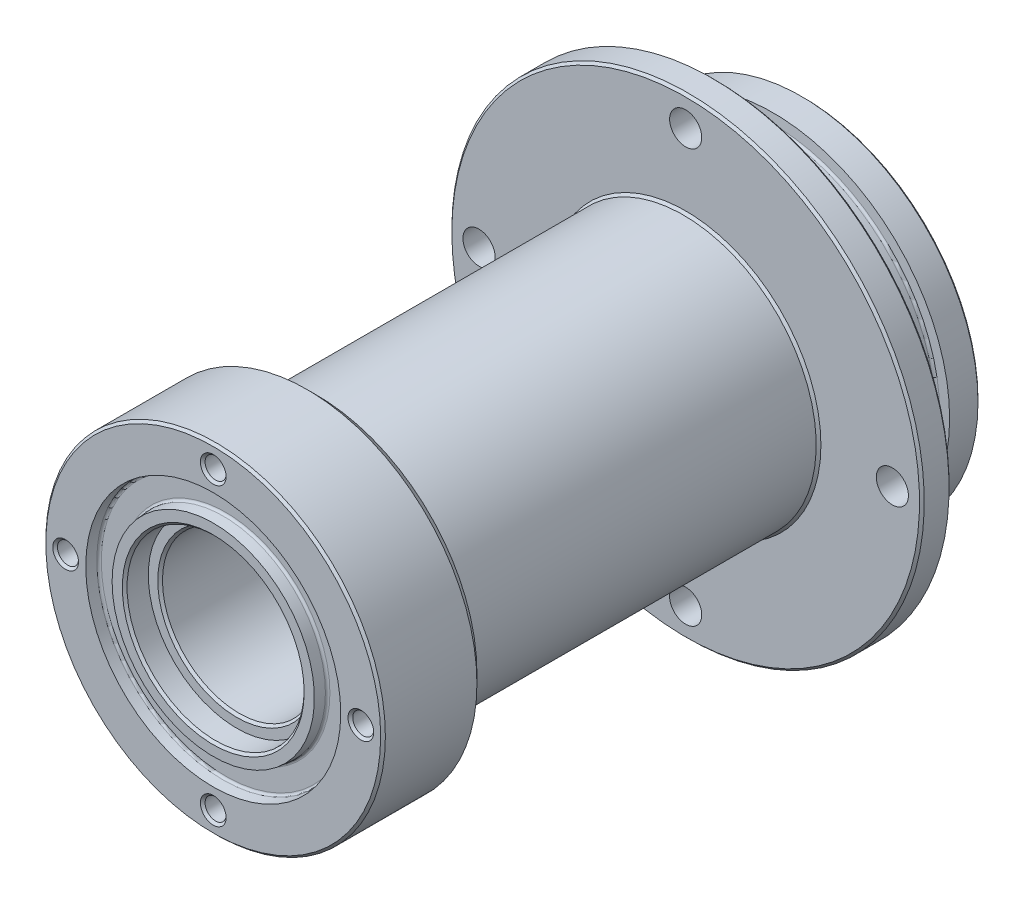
from build123d import *

# Parameters (mm, degrees)
SKETCH1_R           = 18.25625
SKETCH1_R_2         = 7.9883
BODY_DEPTH          = 63.5
SKETCH2_R           = 1.1303
F_4_40_HOLES_DEPTH  = 12.7
SKETCH6_R           = 9.525
CUT_EXTRUDE2_DEPTH  = 2.54
CONNECTOR_SIDE_SIZE = 0.254
SKETCH8_W           = 39.6875
SKETCH8_H           = 6.962926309
CENTER_SIZE         = 1.016
CHAMFER5_SIZE       = 0.254
SKETCH14_R          = 1.7272
MOUNT_HOLES_DEPTH   = 65.835334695
INTRENAL_BORE_SIZE  = 0.254


with BuildPart() as part:
    # Sketch1 → body (new body)
    with BuildSketch(Plane.XY):
        Circle(SKETCH1_R)
        Circle(SKETCH1_R_2, mode=Mode.SUBTRACT)
    extrude(amount=BODY_DEPTH)

    # Sketch2 → 4-40 holes (cut)
    with BuildSketch(Plane.XY.offset(63.5)):
        with Locations((0, 15.875)):
            Circle(SKETCH2_R)
        with Locations((15.875, 0)):
            Circle(SKETCH2_R)
        with Locations((0, -15.875)):
            Circle(SKETCH2_R)
        with Locations((-15.875, 0)):
            Circle(SKETCH2_R)
    extrude(amount=-F_4_40_HOLES_DEPTH, mode=Mode.SUBTRACT)

    # Sketch5 → Groove for AS 568-020_ O-Ring1 (revolve, cut)
    with BuildSketch(Plane(origin=(0, 0, 63.5), x_dir=(0, -1, 0), z_dir=(-1, 0, 0)), mode=Mode.PRIVATE) as groove_for_as_568_020_o_ring1_sk:
        with BuildLine():
            Line((10.9728, -1.088937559), (10.877530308, 0))
            Line((10.877530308, 0), (13.709669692, 0))
            Line((13.709669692, 0), (13.6144, -1.088937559))
            ThreePointArc((13.6144, -1.088937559), (13.532966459, -1.254068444), (13.361366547, -1.3208))
            Line((13.361366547, -1.3208), (11.225833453, -1.3208))
            ThreePointArc((11.225833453, -1.3208), (11.054233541, -1.254068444), (10.9728, -1.088937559))
        make_face()
    revolve(groove_for_as_568_020_o_ring1_sk.sketch.rotate(Axis((0, 0, 113.5), (0, 0, -1)), 90), axis=Axis((0, 0, 113.5), (0, 0, -1)), mode=Mode.SUBTRACT)

    # Sketch6 → Cut-Extrude2 (cut)
    with BuildSketch(Plane.XY.offset(63.5)):
        Circle(SKETCH6_R)
    extrude(amount=-CUT_EXTRUDE2_DEPTH, mode=Mode.SUBTRACT)

    # connector side
    connector_side_edges = [part.edges().sort_by_distance(p)[0] for p in [
        (-1.1303, 15.875, 63.5),
        (14.7447, 0, 63.5),
        (-1.1303, -15.875, 63.5),
        (-17.0053, 0, 63.5),
        (-9.525, 0, 63.5),
        (-18.25625, 0, 63.5),
    ]]
    chamfer(connector_side_edges, length=CONNECTOR_SIDE_SIZE)

    # Sketch8 → center cut (revolve, cut)
    with BuildSketch(Plane(origin=(0, 0, 0), x_dir=(0, 0, -1), z_dir=(1, 0, 0)), mode=Mode.PRIVATE) as center_cut_sk:
        with Locations((-32.54375, 17.768963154)):
            Rectangle(SKETCH8_W, SKETCH8_H)
    revolve(center_cut_sk.sketch.rotate(Axis((0, 0, -3.306435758), (0, 0, 1)), 90), axis=Axis((0, 0, -3.306435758), (0, 0, 1)), mode=Mode.SUBTRACT)

    # center
    center_edges = [part.edges().sort_by_distance(p)[0] for p in [
        (-18.25625, 0, 12.7),
        (-18.25625, 0, 52.3875),
    ]]
    chamfer(center_edges, length=CENTER_SIZE)

    # Sketch11 → flange (revolve)
    with BuildSketch(Plane(origin=(0, 0, 0), x_dir=(0, 0, -1), z_dir=(1, 0, 0)), mode=Mode.PRIVATE) as flange_sk:
        Polygon((-12.7, 16.396142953), (0, 16.396142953), (0, 18.9865), (-9.525, 18.9865), (-9.525, 25.4), (-12.7, 25.4), align=None)
    revolve(flange_sk.sketch.rotate(Axis((0, 0, -3.577141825), (0, 0, 1)), 90), axis=Axis((0, 0, -3.577141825), (0, 0, 1)))

    # Sketch13 → Groove for AS 568-028_ O-Ring1 (revolve, cut)
    with BuildSketch(Plane(origin=(0, 0, -3.577141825), x_dir=(0, 1, 0), z_dir=(-1, 0, 0)), mode=Mode.PRIVATE) as groove_for_as_568_028_o_ring1_sk:
        with BuildLine():
            Line((18.011862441, -6.967620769), (19.1389, -6.869017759))
            Line((19.1389, -6.869017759), (19.1389, -9.428423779))
            Line((19.1389, -9.428423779), (18.011862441, -9.329820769))
            ThreePointArc((18.011862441, -9.329820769), (17.846731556, -9.248387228), (17.78, -9.076787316))
            Line((17.78, -9.076787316), (17.78, -7.220654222))
            ThreePointArc((17.78, -7.220654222), (17.846731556, -7.04905431), (18.011862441, -6.967620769))
        make_face()
    revolve(groove_for_as_568_028_o_ring1_sk.sketch.rotate(Axis((0, 0, -53.577141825), (0, 0, 1)), 270), axis=Axis((0, 0, -53.577141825), (0, 0, 1)), mode=Mode.SUBTRACT)

    # Chamfer5
    chamfer5_edges = [part.edges().sort_by_distance(p)[0] for p in [
        (-7.9883, 0, 0),
        (14.2875, 0, 52.3875),
        (14.2875, 0, 12.7),
        (18.9865, 0, 0),
        (25.4, 0, 9.525),
        (25.4, 0, 12.7),
    ]]
    chamfer(chamfer5_edges, length=CHAMFER5_SIZE)

    # Sketch14 → mount holes (cut, through all)
    with BuildSketch(Plane(origin=(0, 0, 9.525), x_dir=(-1, 0, 0), z_dir=(0, 0, -1))):
        with Locations((0, 22.225)):
            Circle(SKETCH14_R)
        with Locations((-22.225, 0)):
            Circle(SKETCH14_R)
        with Locations((0, -22.225)):
            Circle(SKETCH14_R)
        with Locations((22.225, 0)):
            Circle(SKETCH14_R)
    extrude(amount=-MOUNT_HOLES_DEPTH, mode=Mode.SUBTRACT)

    # Sketch15 → internal thread and bore (revolve, cut)
    with BuildSketch(Plane(origin=(0, 0, 0), x_dir=(1, 0, 0), z_dir=(0, 1, 0))):
        Polygon((0, -19.05), (0, -65.696700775), (8.255, -65.696700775), (8.255, -25.4), (8.128, -25.4), (8.128, -19.05), align=None)
    revolve(axis=Axis((0, 0, 0), (0, 0, 1)), mode=Mode.SUBTRACT)

    # intrenal bore
    intrenal_bore_edges = [part.edges().sort_by_distance(p)[0] for p in [
        (-8.255, 0, 60.96),
    ]]
    chamfer(intrenal_bore_edges, length=INTRENAL_BORE_SIZE)


solid = part.part
